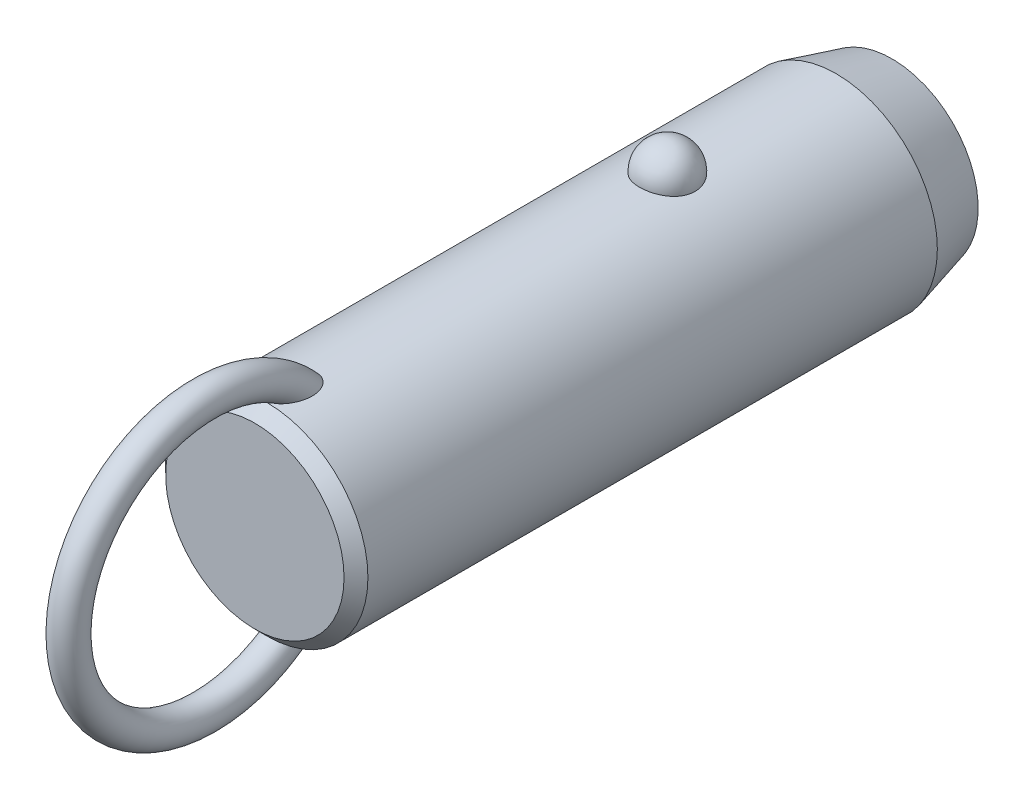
ISO-10303-21;
HEADER;
FILE_DESCRIPTION(('STEP AP214'),'2;1');
FILE_NAME('part.step','',(''),(''),'','','');
FILE_SCHEMA(('AUTOMOTIVE_DESIGN { 1 0 10303 214 1 1 1 1 }'));
ENDSEC;
DATA;
#1=APPLICATION_CONTEXT('core data for automotive mechanical design processes');
#2=APPLICATION_PROTOCOL_DEFINITION('international standard','automotive_design',2000,#1);
#3=PRODUCT_CONTEXT('',#1,'mechanical');
#4=PRODUCT('Part','Part','',(#3));
#5=PRODUCT_RELATED_PRODUCT_CATEGORY('part','',(#4));
#6=PRODUCT_DEFINITION_FORMATION('','',#4);
#7=PRODUCT_DEFINITION_CONTEXT('part definition',#1,'design');
#8=PRODUCT_DEFINITION('design','',#6,#7);
#9=PRODUCT_DEFINITION_SHAPE('','',#8);
#10=(LENGTH_UNIT() NAMED_UNIT(*) SI_UNIT(.MILLI.,.METRE.));
#11=(NAMED_UNIT(*) PLANE_ANGLE_UNIT() SI_UNIT($,.RADIAN.));
#12=(NAMED_UNIT(*) SI_UNIT($,.STERADIAN.) SOLID_ANGLE_UNIT());
#13=UNCERTAINTY_MEASURE_WITH_UNIT(LENGTH_MEASURE(1.E-05),#10,'distance_accuracy_value','');
#14=(GEOMETRIC_REPRESENTATION_CONTEXT(3) GLOBAL_UNCERTAINTY_ASSIGNED_CONTEXT((#13)) GLOBAL_UNIT_ASSIGNED_CONTEXT((#10,
#11,#12)) REPRESENTATION_CONTEXT('',''));
#15=CARTESIAN_POINT('',(0.,0.,0.));
#16=DIRECTION('',(0.,0.,1.));
#17=DIRECTION('',(1.,0.,0.));
#18=AXIS2_PLACEMENT_3D('',#15,#16,#17);
#19=CARTESIAN_POINT('',(0.,0.,35.6));
#20=DIRECTION('',(0.,0.,-1.));
#21=DIRECTION('',(-1.,0.,0.));
#22=AXIS2_PLACEMENT_3D('',#19,#20,#21);
#23=CYLINDRICAL_SURFACE('',#22,12.7);
#24=CARTESIAN_POINT('',(3.46661256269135,12.2177165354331,-3.5));
#25=CARTESIAN_POINT('',(3.4666090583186,12.2177194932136,-3.30432790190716));
#26=CARTESIAN_POINT('',(3.45063567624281,12.2222841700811,-3.10861112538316));
#27=CARTESIAN_POINT('',(3.38712451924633,12.2400345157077,-2.72271899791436));
#28=CARTESIAN_POINT('',(3.33957415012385,12.2532236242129,-2.53254588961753));
#29=CARTESIAN_POINT('',(3.2141234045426,12.286724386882,-2.16324948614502));
#30=CARTESIAN_POINT('',(3.13623639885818,12.3070329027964,-1.98412136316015));
#31=CARTESIAN_POINT('',(2.95205930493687,12.3525018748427,-1.64180592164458));
#32=CARTESIAN_POINT('',(2.84577003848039,12.3776621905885,-1.47861814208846));
#33=CARTESIAN_POINT('',(2.60688050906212,12.4301712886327,-1.17190583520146));
#34=CARTESIAN_POINT('',(2.47415697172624,12.4575299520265,-1.02847897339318));
#35=CARTESIAN_POINT('',(2.18615174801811,12.5112810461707,-0.76617774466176));
#36=CARTESIAN_POINT('',(2.03087002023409,12.5376734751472,-0.647303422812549));
#37=CARTESIAN_POINT('',(1.70237334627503,12.5864761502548,-0.437732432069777));
#38=CARTESIAN_POINT('',(1.52920948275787,12.6088972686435,-0.346958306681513));
#39=CARTESIAN_POINT('',(1.16944170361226,12.6473352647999,-0.195750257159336));
#40=CARTESIAN_POINT('',(0.982839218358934,12.663352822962,-0.13531310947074));
#41=CARTESIAN_POINT('',(0.604961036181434,12.6869706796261,-0.0473241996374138));
#42=CARTESIAN_POINT('',(0.41382314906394,12.6947125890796,-0.0192185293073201));
#43=CARTESIAN_POINT('',(0.0293827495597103,12.7014203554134,0.00517254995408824));
#44=CARTESIAN_POINT('',(-0.163919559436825,12.7003870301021,0.00146092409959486));
#45=CARTESIAN_POINT('',(-0.544374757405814,12.689735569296,-0.037393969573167));
#46=CARTESIAN_POINT('',(-0.731575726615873,12.6802364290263,-0.072101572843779));
#47=CARTESIAN_POINT('',(-1.09733277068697,12.6538333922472,-0.171364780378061));
#48=CARTESIAN_POINT('',(-1.27588869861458,12.6369293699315,-0.235920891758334));
#49=CARTESIAN_POINT('',(-1.6204698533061,12.5973946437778,-0.393548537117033));
#50=CARTESIAN_POINT('',(-1.78641865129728,12.5747321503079,-0.486778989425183));
#51=CARTESIAN_POINT('',(-2.10030671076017,12.5261316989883,-0.699110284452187));
#52=CARTESIAN_POINT('',(-2.24824419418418,12.5001934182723,-0.818213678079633));
#53=CARTESIAN_POINT('',(-2.52491489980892,12.4472906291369,-1.08157124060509));
#54=CARTESIAN_POINT('',(-2.65324222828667,12.4203160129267,-1.22624992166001));
#55=CARTESIAN_POINT('',(-2.88410007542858,12.3687509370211,-1.53528325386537));
#56=CARTESIAN_POINT('',(-2.98662883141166,12.3441606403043,-1.69963924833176));
#57=CARTESIAN_POINT('',(-3.16432417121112,12.2998199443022,-2.04548497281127));
#58=CARTESIAN_POINT('',(-3.23917525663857,12.2801261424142,-2.22714424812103));
#59=CARTESIAN_POINT('',(-3.35800573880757,12.248167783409,-2.6009138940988));
#60=CARTESIAN_POINT('',(-3.4019860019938,12.2359030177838,-2.79302397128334));
#61=CARTESIAN_POINT('',(-3.45784812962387,12.2202347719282,-3.18140279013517));
#62=CARTESIAN_POINT('',(-3.46986123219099,12.2167950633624,-3.37765118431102));
#63=CARTESIAN_POINT('',(-3.46186273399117,12.2190638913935,-3.76943689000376));
#64=CARTESIAN_POINT('',(-3.44185196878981,12.2247721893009,-3.96497421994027));
#65=CARTESIAN_POINT('',(-3.37048652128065,12.2446381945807,-4.34881728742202));
#66=CARTESIAN_POINT('',(-3.31928253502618,12.2587552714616,-4.53715319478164));
#67=CARTESIAN_POINT('',(-3.18693461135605,12.2938237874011,-4.90231727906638));
#68=CARTESIAN_POINT('',(-3.1057895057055,12.3147754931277,-5.07914500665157));
#69=CARTESIAN_POINT('',(-2.91506431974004,12.3613125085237,-5.41732059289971));
#70=CARTESIAN_POINT('',(-2.80533587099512,12.3869217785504,-5.57858147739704));
#71=CARTESIAN_POINT('',(-2.560414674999,12.4398525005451,-5.88013283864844));
#72=CARTESIAN_POINT('',(-2.42522099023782,12.4671740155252,-6.02042254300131));
#73=CARTESIAN_POINT('',(-2.1323357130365,12.5205965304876,-6.27662798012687));
#74=CARTESIAN_POINT('',(-1.97456596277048,12.5466928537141,-6.3924554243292));
#75=CARTESIAN_POINT('',(-1.64115839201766,12.5946384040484,-6.59583547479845));
#76=CARTESIAN_POINT('',(-1.46552179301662,12.6164879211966,-6.68339001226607));
#77=CARTESIAN_POINT('',(-1.10356050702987,12.6532533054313,-6.82682153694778));
#78=CARTESIAN_POINT('',(-0.9173913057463,12.6682500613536,-6.8830698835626));
#79=CARTESIAN_POINT('',(-0.537836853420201,12.6900288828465,-6.96386887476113));
#80=CARTESIAN_POINT('',(-0.344452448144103,12.6968119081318,-6.9884232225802));
#81=CARTESIAN_POINT('',(0.0402577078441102,12.7013667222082,-7.00496469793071));
#82=CARTESIAN_POINT('',(0.231556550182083,12.6993008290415,-6.99753844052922));
#83=CARTESIAN_POINT('',(0.610105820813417,12.6867505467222,-6.9516636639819));
#84=CARTESIAN_POINT('',(0.797356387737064,12.6762664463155,-6.91321620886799));
#85=CARTESIAN_POINT('',(1.16186657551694,12.6480587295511,-6.80658431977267));
#86=CARTESIAN_POINT('',(1.33915951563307,12.6303611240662,-6.73850666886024));
#87=CARTESIAN_POINT('',(1.67968518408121,12.5896027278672,-6.57450875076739));
#88=CARTESIAN_POINT('',(1.84291705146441,12.5665416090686,-6.47858678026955));
#89=CARTESIAN_POINT('',(2.15340192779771,12.5171072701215,-6.25982455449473));
#90=CARTESIAN_POINT('',(2.30037831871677,12.4906895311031,-6.13660186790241));
#91=CARTESIAN_POINT('',(2.5717412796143,12.4376567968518,-5.86739587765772));
#92=CARTESIAN_POINT('',(2.69612388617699,12.4110417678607,-5.72140858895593));
#93=CARTESIAN_POINT('',(2.92107785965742,12.360051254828,-5.40794137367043));
#94=CARTESIAN_POINT('',(3.02121329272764,12.3357209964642,-5.24014110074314));
#95=CARTESIAN_POINT('',(3.19236291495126,12.2925446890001,-4.8896986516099));
#96=CARTESIAN_POINT('',(3.26338839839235,12.2736965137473,-4.70706226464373));
#97=CARTESIAN_POINT('',(3.36788038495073,12.245404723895,-4.35469510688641));
#98=CARTESIAN_POINT('',(3.40484026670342,12.2351018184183,-4.18605935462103));
#99=CARTESIAN_POINT('',(3.45420764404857,12.2212564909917,-3.84496058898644));
#100=CARTESIAN_POINT('',(3.46661565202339,12.2177139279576,-3.67249765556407));
#101=CARTESIAN_POINT('',(3.46661256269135,12.2177165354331,-3.5));
#102=B_SPLINE_CURVE_WITH_KNOTS('',3,(#24,#25,#26,#27,#28,#29,#30,#31,#32,#33,#34,#35,#36,#37,
#38,#39,#40,#41,#42,#43,#44,#45,#46,#47,#48,#49,#50,#51,#52,#53,#54,#55,#56,#57,#58,#59,#60,#61,
#62,#63,#64,#65,#66,#67,#68,#69,#70,#71,#72,#73,#74,#75,#76,#77,#78,#79,#80,#81,#82,#83,#84,#85,
#86,#87,#88,#89,#90,#91,#92,#93,#94,#95,#96,#97,#98,#99,#100,#101),.UNSPECIFIED.,.T.,.F.,(4,2,2,
2,2,2,2,2,2,2,2,2,2,2,2,2,2,2,2,2,2,2,2,2,2,2,2,2,2,2,2,2,2,2,2,2,2,2,4),(0.,0.586396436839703,
1.17302689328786,1.7593990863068,2.34575431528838,2.93491084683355,3.52406845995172,
4.11158733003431,4.69904375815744,5.2762784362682,5.85345931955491,6.42265312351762,
6.99185659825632,7.56427334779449,8.136746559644,8.71981013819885,9.3029135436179,
9.89247258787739,10.4820150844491,11.0691335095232,11.6562366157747,12.2405256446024,
12.8248374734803,13.412244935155,13.9996740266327,14.5891883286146,15.1786623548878,
15.7609861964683,16.3432419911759,16.9148635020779,17.4864654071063,18.0560241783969,
18.6256177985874,19.2037609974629,19.7820055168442,20.3699810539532,20.957728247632,
21.4746855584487,21.9916320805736),.UNSPECIFIED.);
#103=CARTESIAN_POINT('',(3.46661256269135,12.2177165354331,-3.5));
#104=VERTEX_POINT('',#103);
#105=EDGE_CURVE('E41',#104,#104,#102,.T.);
#106=ORIENTED_EDGE('',*,*,#105,.T.);
#107=EDGE_LOOP('',(#106));
#108=FACE_BOUND('',#107,.T.);
#109=CARTESIAN_POINT('',(0.,0.,46.8));
#110=DIRECTION('',(0.,0.,1.));
#111=DIRECTION('',(1.,0.,0.));
#112=AXIS2_PLACEMENT_3D('',#109,#110,#111);
#113=CIRCLE('',#112,12.7);
#114=CARTESIAN_POINT('',(12.7,0.,46.8));
#115=VERTEX_POINT('',#114);
#116=EDGE_CURVE('E10',#115,#115,#113,.F.);
#117=ORIENTED_EDGE('',*,*,#116,.T.);
#118=EDGE_LOOP('',(#117));
#119=FACE_BOUND('',#118,.T.);
#120=CARTESIAN_POINT('',(-0.548122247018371,-12.6881662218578,40.5432187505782));
#121=CARTESIAN_POINT('',(-0.648865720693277,-12.6838128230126,40.577926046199));
#122=CARTESIAN_POINT('',(-0.746398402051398,-12.6783867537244,40.6220428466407));
#123=CARTESIAN_POINT('',(-0.932125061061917,-12.666091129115,40.7267647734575));
#124=CARTESIAN_POINT('',(-1.02030388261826,-12.6592192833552,40.787396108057));
#125=CARTESIAN_POINT('',(-1.18487740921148,-12.6448747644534,40.921847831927));
#126=CARTESIAN_POINT('',(-1.26134296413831,-12.637406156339,40.9955825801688));
#127=CARTESIAN_POINT('',(-1.4023120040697,-12.6225412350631,41.1536045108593));
#128=CARTESIAN_POINT('',(-1.46681470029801,-12.6151449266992,41.2378923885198));
#129=CARTESIAN_POINT('',(-1.60714786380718,-12.5981718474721,41.4496577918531));
#130=CARTESIAN_POINT('',(-1.67725126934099,-12.588900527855,41.580962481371));
#131=CARTESIAN_POINT('',(-1.79536591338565,-12.5725964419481,41.8532471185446));
#132=CARTESIAN_POINT('',(-1.84333535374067,-12.5655679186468,41.9942447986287));
#133=CARTESIAN_POINT('',(-1.93422576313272,-12.5519624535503,42.3376455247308));
#134=CARTESIAN_POINT('',(-1.96788773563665,-12.5466298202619,42.5425578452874));
#135=CARTESIAN_POINT('',(-1.9941399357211,-12.542463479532,42.8517600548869));
#136=CARTESIAN_POINT('',(-1.99883864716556,-12.5417153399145,42.9552987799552));
#137=CARTESIAN_POINT('',(-2.00078003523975,-12.5414074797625,43.1624512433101));
#138=CARTESIAN_POINT('',(-1.99802449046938,-12.5418474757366,43.2660649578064));
#139=CARTESIAN_POINT('',(-1.98336733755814,-12.5441750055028,43.5103207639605));
#140=CARTESIAN_POINT('',(-1.96851430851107,-12.5465291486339,43.6507804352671));
#141=CARTESIAN_POINT('',(-1.92707089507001,-12.5529612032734,43.9299607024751));
#142=CARTESIAN_POINT('',(-1.90047458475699,-12.5570399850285,44.0686803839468));
#143=CARTESIAN_POINT('',(-1.83619120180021,-12.5666008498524,44.3434113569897));
#144=CARTESIAN_POINT('',(-1.79850828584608,-12.57208240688,44.4794236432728));
#145=CARTESIAN_POINT('',(-1.71223796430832,-12.5841228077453,44.7478421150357));
#146=CARTESIAN_POINT('',(-1.66365679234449,-12.5906810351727,44.8802503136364));
#147=CARTESIAN_POINT('',(-1.5780450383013,-12.6016176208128,45.0854887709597));
#148=CARTESIAN_POINT('',(-1.54477252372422,-12.6057501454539,45.1599149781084));
#149=CARTESIAN_POINT('',(-1.47424480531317,-12.6141930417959,45.3068393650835));
#150=CARTESIAN_POINT('',(-1.43699041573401,-12.6185033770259,45.3793379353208));
#151=CARTESIAN_POINT('',(-1.35825795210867,-12.6272207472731,45.5218926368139));
#152=CARTESIAN_POINT('',(-1.31678520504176,-12.6316276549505,45.5919517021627));
#153=CARTESIAN_POINT('',(-1.22917793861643,-12.6404532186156,45.7290705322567));
#154=CARTESIAN_POINT('',(-1.18304514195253,-12.6448718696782,45.7961313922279));
#155=CARTESIAN_POINT('',(-1.07246411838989,-12.6547893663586,45.9438741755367));
#156=CARTESIAN_POINT('',(-1.00642239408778,-12.6602600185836,46.0233844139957));
#157=CARTESIAN_POINT('',(-0.86444142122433,-12.6707460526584,46.1731698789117));
#158=CARTESIAN_POINT('',(-0.788516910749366,-12.6757620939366,46.2434585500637));
#159=CARTESIAN_POINT('',(-0.652215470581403,-12.6833591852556,46.3486801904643));
#160=CARTESIAN_POINT('',(-0.594982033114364,-12.6861973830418,46.3876241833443));
#161=CARTESIAN_POINT('',(-0.47526962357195,-12.6912445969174,46.4564899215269));
#162=CARTESIAN_POINT('',(-0.412800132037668,-12.6934547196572,46.4864275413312));
#163=CARTESIAN_POINT('',(-0.295749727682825,-12.6966636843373,46.5297565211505));
#164=CARTESIAN_POINT('',(-0.241949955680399,-12.6978134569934,46.5452188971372));
#165=CARTESIAN_POINT('',(-0.132508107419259,-12.6994261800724,46.5668845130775));
#166=CARTESIAN_POINT('',(-0.0768679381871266,-12.6998898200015,46.5730970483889));
#167=CARTESIAN_POINT('',(0.0347696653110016,-12.7000752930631,46.5755838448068));
#168=CARTESIAN_POINT('',(0.0907676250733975,-12.6997954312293,46.5718353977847));
#169=CARTESIAN_POINT('',(0.201283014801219,-12.6985255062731,46.5547883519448));
#170=CARTESIAN_POINT('',(0.255799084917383,-12.6975348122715,46.5414812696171));
#171=CARTESIAN_POINT('',(0.37604233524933,-12.6946091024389,46.5020379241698));
#172=CARTESIAN_POINT('',(0.440950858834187,-12.6924943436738,46.4734492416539));
#173=CARTESIAN_POINT('',(0.565350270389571,-12.6875639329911,46.4063234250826));
#174=CARTESIAN_POINT('',(0.624828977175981,-12.6847467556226,46.3677646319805));
#175=CARTESIAN_POINT('',(0.774116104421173,-12.6767252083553,46.256949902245));
#176=CARTESIAN_POINT('',(0.859449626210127,-12.6711344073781,46.1787605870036));
#177=CARTESIAN_POINT('',(1.01789440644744,-12.6593922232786,46.010943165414));
#178=CARTESIAN_POINT('',(1.09096902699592,-12.653239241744,45.921282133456));
#179=CARTESIAN_POINT('',(1.22268793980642,-12.6411674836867,45.7402658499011));
#180=CARTESIAN_POINT('',(1.28193986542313,-12.6352572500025,45.649345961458));
#181=CARTESIAN_POINT('',(1.39259777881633,-12.6235401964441,45.4627929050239));
#182=CARTESIAN_POINT('',(1.44399707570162,-12.6177334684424,45.3671558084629));
#183=CARTESIAN_POINT('',(1.53972870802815,-12.6064093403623,45.1722738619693));
#184=CARTESIAN_POINT('',(1.58405262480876,-12.6008922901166,45.0730248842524));
#185=CARTESIAN_POINT('',(1.66600705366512,-12.5903187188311,44.8717727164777));
#186=CARTESIAN_POINT('',(1.7036365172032,-12.5852622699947,44.7697690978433));
#187=CARTESIAN_POINT('',(1.77545379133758,-12.5753406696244,44.5543580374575));
#188=CARTESIAN_POINT('',(1.80903453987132,-12.5705328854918,44.440745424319));
#189=CARTESIAN_POINT('',(1.86844163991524,-12.5618400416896,44.2114575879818));
#190=CARTESIAN_POINT('',(1.89426665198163,-12.5579551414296,44.0957820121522));
#191=CARTESIAN_POINT('',(1.9378546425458,-12.5513030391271,43.8630072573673));
#192=CARTESIAN_POINT('',(1.9556264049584,-12.5485346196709,43.7459097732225));
#193=CARTESIAN_POINT('',(1.98264463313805,-12.5442934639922,43.5107473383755));
#194=CARTESIAN_POINT('',(1.99189298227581,-12.5428204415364,43.3926826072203));
#195=CARTESIAN_POINT('',(2.00416068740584,-12.540871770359,43.0806225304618));
#196=CARTESIAN_POINT('',(1.99944433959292,-12.541631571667,42.8862290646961));
#197=CARTESIAN_POINT('',(1.96113755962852,-12.5476846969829,42.5003095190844));
#198=CARTESIAN_POINT('',(1.92758341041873,-12.5529723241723,42.3087801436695));
#199=CARTESIAN_POINT('',(1.8393434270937,-12.5661532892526,41.9822728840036));
#200=CARTESIAN_POINT('',(1.79215440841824,-12.5730485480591,41.8452499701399));
#201=CARTESIAN_POINT('',(1.67676242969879,-12.588958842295,41.5804459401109));
#202=CARTESIAN_POINT('',(1.60859050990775,-12.597970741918,41.4526515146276));
#203=CARTESIAN_POINT('',(1.46583832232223,-12.6152829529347,41.2358006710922));
#204=CARTESIAN_POINT('',(1.39525727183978,-12.6233659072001,41.1441050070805));
#205=CARTESIAN_POINT('',(1.23992594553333,-12.6395676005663,40.9734854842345));
#206=CARTESIAN_POINT('',(1.15517932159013,-12.6476863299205,40.8945583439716));
#207=CARTESIAN_POINT('',(0.97199516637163,-12.6630846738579,40.7526438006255));
#208=CARTESIAN_POINT('',(0.873456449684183,-12.6703572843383,40.6897849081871));
#209=CARTESIAN_POINT('',(0.665847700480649,-12.6829569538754,40.5844870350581));
#210=CARTESIAN_POINT('',(0.556784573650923,-12.688285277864,40.5420347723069));
#211=CARTESIAN_POINT('',(0.347338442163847,-12.6956226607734,40.4844434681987));
#212=CARTESIAN_POINT('',(0.247759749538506,-12.6979816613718,40.4663996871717));
#213=CARTESIAN_POINT('',(0.0470218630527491,-12.7003077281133,40.4486007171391));
#214=CARTESIAN_POINT('',(-0.0541350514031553,-12.7002779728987,40.4488212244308));
#215=CARTESIAN_POINT('',(-0.221414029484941,-12.6982482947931,40.4643639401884));
#216=CARTESIAN_POINT('',(-0.288055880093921,-12.6969033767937,40.4746662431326));
#217=CARTESIAN_POINT('',(-0.419599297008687,-12.6932369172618,40.5031348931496));
#218=CARTESIAN_POINT('',(-0.484501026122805,-12.6909154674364,40.5213005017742));
#219=CARTESIAN_POINT('',(-0.548122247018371,-12.6881662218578,40.5432187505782));
#220=B_SPLINE_CURVE_WITH_KNOTS('',3,(#120,#121,#122,#123,#124,#125,#126,#127,#128,#129,#130,
#131,#132,#133,#134,#135,#136,#137,#138,#139,#140,#141,#142,#143,#144,#145,#146,#147,#148,#149,
#150,#151,#152,#153,#154,#155,#156,#157,#158,#159,#160,#161,#162,#163,#164,#165,#166,#167,#168,
#169,#170,#171,#172,#173,#174,#175,#176,#177,#178,#179,#180,#181,#182,#183,#184,#185,#186,#187,
#188,#189,#190,#191,#192,#193,#194,#195,#196,#197,#198,#199,#200,#201,#202,#203,#204,#205,#206,
#207,#208,#209,#210,#211,#212,#213,#214,#215,#216,#217,#218,#219),.UNSPECIFIED.,.T.,.F.,(4,2,2,
2,2,2,2,2,2,2,2,2,2,2,2,2,2,2,2,2,2,2,2,2,2,2,2,2,2,2,2,2,2,2,2,2,2,2,2,2,2,2,2,2,2,2,2,2,2,4),
(0.,0.319642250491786,0.63979475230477,0.957927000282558,1.27608021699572,1.72100165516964,
2.16675988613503,2.78630021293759,3.09705782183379,3.40774128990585,3.83096358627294,
4.25439969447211,4.67767724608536,5.10071330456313,5.34550297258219,5.59024267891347,
5.83467707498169,6.07902143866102,6.38891080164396,6.69834321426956,6.90560910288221,
7.11250749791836,7.27977315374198,7.44687060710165,7.61434932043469,7.78197685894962,
7.99365544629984,8.20579780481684,8.55147335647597,8.89816429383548,9.22375138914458,
9.54961437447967,9.8758622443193,10.202161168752,10.557587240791,10.9130746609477,
11.2681734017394,11.6231936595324,12.2046601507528,12.7853961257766,13.219164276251,
13.6522938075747,13.9989174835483,14.3454519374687,14.6946768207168,15.0436740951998,
15.3457513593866,15.6474266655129,15.8493051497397,16.0511646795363),.UNSPECIFIED.);
#221=CARTESIAN_POINT('',(-0.548122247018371,-12.6881662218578,40.5432187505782));
#222=VERTEX_POINT('',#221);
#223=EDGE_CURVE('E59',#222,#222,#220,.T.);
#224=ORIENTED_EDGE('',*,*,#223,.T.);
#225=EDGE_LOOP('',(#224));
#226=FACE_BOUND('',#225,.T.);
#227=CARTESIAN_POINT('',(-0.548122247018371,12.6881662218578,40.5432187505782));
#228=CARTESIAN_POINT('',(-0.459436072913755,12.6919968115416,40.512673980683));
#229=CARTESIAN_POINT('',(-0.368189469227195,12.6949996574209,40.4893913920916));
#230=CARTESIAN_POINT('',(-0.183024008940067,12.6990186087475,40.4584062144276));
#231=CARTESIAN_POINT('',(-0.0891049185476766,12.7000345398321,40.4507049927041));
#232=CARTESIAN_POINT('',(0.0987147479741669,12.6999636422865,40.4512455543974));
#233=CARTESIAN_POINT('',(0.192615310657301,12.6988761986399,40.4594920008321));
#234=CARTESIAN_POINT('',(0.377658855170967,12.6947211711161,40.4915515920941));
#235=CARTESIAN_POINT('',(0.468801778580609,12.6916535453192,40.5153650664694));
#236=CARTESIAN_POINT('',(0.645809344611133,12.6838788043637,40.5774565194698));
#237=CARTESIAN_POINT('',(0.731679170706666,12.6791733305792,40.615720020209));
#238=CARTESIAN_POINT('',(0.896315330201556,12.6686004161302,40.705120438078));
#239=CARTESIAN_POINT('',(0.975080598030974,12.6627328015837,40.7562592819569));
#240=CARTESIAN_POINT('',(1.12963655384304,12.6499161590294,40.8736782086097));
#241=CARTESIAN_POINT('',(1.20478673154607,12.6429194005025,40.9407929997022));
#242=CARTESIAN_POINT('',(1.34448241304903,12.6288282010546,41.0852250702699));
#243=CARTESIAN_POINT('',(1.40902173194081,12.621733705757,41.1625482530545));
#244=CARTESIAN_POINT('',(1.55208211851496,12.6050877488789,41.3592475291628));
#245=CARTESIAN_POINT('',(1.62510490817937,12.5957546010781,41.4826540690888));
#246=CARTESIAN_POINT('',(1.7501904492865,12.5789823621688,41.7397690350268));
#247=CARTESIAN_POINT('',(1.80221377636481,12.5715468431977,41.873496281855));
#248=CARTESIAN_POINT('',(1.90309965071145,12.5567434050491,42.1983516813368));
#249=CARTESIAN_POINT('',(1.94342317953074,12.5504515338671,42.3921611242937));
#250=CARTESIAN_POINT('',(1.99332997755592,12.5426147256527,42.7837881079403));
#251=CARTESIAN_POINT('',(2.00285305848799,12.5410790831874,42.981612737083));
#252=CARTESIAN_POINT('',(1.99678999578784,12.5420407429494,43.3166427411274));
#253=CARTESIAN_POINT('',(1.98794117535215,12.5434564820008,43.4540428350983));
#254=CARTESIAN_POINT('',(1.95865119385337,12.5480641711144,43.7276394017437));
#255=CARTESIAN_POINT('',(1.93820436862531,12.5512569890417,43.8638352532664));
#256=CARTESIAN_POINT('',(1.88647896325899,12.5591352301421,44.1342493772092));
#257=CARTESIAN_POINT('',(1.85518800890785,12.5638223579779,44.2684652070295));
#258=CARTESIAN_POINT('',(1.78217886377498,12.5743868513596,44.5339362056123));
#259=CARTESIAN_POINT('',(1.74046509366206,12.5802637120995,44.6651926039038));
#260=CARTESIAN_POINT('',(1.66024095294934,12.5910571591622,44.8860855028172));
#261=CARTESIAN_POINT('',(1.62434772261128,12.5957535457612,44.9766904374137));
#262=CARTESIAN_POINT('',(1.54709009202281,12.6054762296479,45.1555125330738));
#263=CARTESIAN_POINT('',(1.50572681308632,12.6105024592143,45.2437301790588));
#264=CARTESIAN_POINT('',(1.41728020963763,12.620748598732,45.4169321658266));
#265=CARTESIAN_POINT('',(1.37021377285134,12.625967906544,45.5019251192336));
#266=CARTESIAN_POINT('',(1.26969620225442,12.6364721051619,45.6680072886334));
#267=CARTESIAN_POINT('',(1.21624929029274,12.6417569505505,45.7490990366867));
#268=CARTESIAN_POINT('',(1.10304413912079,12.6521331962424,45.9047027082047));
#269=CARTESIAN_POINT('',(1.04340936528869,12.657226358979,45.9793033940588));
#270=CARTESIAN_POINT('',(0.915919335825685,12.6670906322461,46.121324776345));
#271=CARTESIAN_POINT('',(0.84806456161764,12.6718617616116,46.1887458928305));
#272=CARTESIAN_POINT('',(0.717035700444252,12.67987711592,46.3006247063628));
#273=CARTESIAN_POINT('',(0.655526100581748,12.6832377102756,46.3469970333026));
#274=CARTESIAN_POINT('',(0.525985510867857,12.6892676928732,46.4296195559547));
#275=CARTESIAN_POINT('',(0.457969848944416,12.6919386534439,46.4658927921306));
#276=CARTESIAN_POINT('',(0.334859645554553,12.695691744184,46.5166572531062));
#277=CARTESIAN_POINT('',(0.281116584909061,12.6970073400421,46.5343733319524));
#278=CARTESIAN_POINT('',(0.171425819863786,12.6989609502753,46.5606429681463));
#279=CARTESIAN_POINT('',(0.115480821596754,12.699599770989,46.5692074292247));
#280=CARTESIAN_POINT('',(0.00272618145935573,12.7001251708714,46.5762531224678));
#281=CARTESIAN_POINT('',(-0.0540859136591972,12.7000089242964,46.5746964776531));
#282=CARTESIAN_POINT('',(-0.166544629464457,12.6990328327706,46.5616005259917));
#283=CARTESIAN_POINT('',(-0.222190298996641,12.6981724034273,46.5500533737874));
#284=CARTESIAN_POINT('',(-0.342018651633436,12.695562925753,46.5149128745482));
#285=CARTESIAN_POINT('',(-0.405606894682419,12.6936676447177,46.4893322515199));
#286=CARTESIAN_POINT('',(-0.527815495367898,12.6891754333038,46.4283111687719));
#287=CARTESIAN_POINT('',(-0.586425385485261,12.6865770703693,46.3928505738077));
#288=CARTESIAN_POINT('',(-0.731842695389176,12.6792129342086,46.2914960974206));
#289=CARTESIAN_POINT('',(-0.814709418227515,12.6740767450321,46.2200395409));
#290=CARTESIAN_POINT('',(-0.969101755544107,12.6632083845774,46.0658900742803));
#291=CARTESIAN_POINT('',(-1.04059564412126,12.6574746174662,45.9831668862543));
#292=CARTESIAN_POINT('',(-1.1698111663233,12.6461638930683,45.8158096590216));
#293=CARTESIAN_POINT('',(-1.22811369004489,12.6405994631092,45.7316166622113));
#294=CARTESIAN_POINT('',(-1.33743405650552,12.6295007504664,45.5585791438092));
#295=CARTESIAN_POINT('',(-1.38844577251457,12.6239664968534,45.4697307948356));
#296=CARTESIAN_POINT('',(-1.48400702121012,12.6130898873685,45.2883895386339));
#297=CARTESIAN_POINT('',(-1.52854232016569,12.6077479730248,45.1958891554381));
#298=CARTESIAN_POINT('',(-1.61150113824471,12.5974127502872,45.0081607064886));
#299=CARTESIAN_POINT('',(-1.64992317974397,12.5924195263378,44.9129319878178));
#300=CARTESIAN_POINT('',(-1.73468589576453,12.581070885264,44.6828936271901));
#301=CARTESIAN_POINT('',(-1.77831261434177,12.5749388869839,44.5470661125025));
#302=CARTESIAN_POINT('',(-1.85439734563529,12.5639437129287,44.2722128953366));
#303=CARTESIAN_POINT('',(-1.88684994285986,12.5590811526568,44.1331856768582));
#304=CARTESIAN_POINT('',(-1.9400848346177,12.550968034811,43.8530923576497));
#305=CARTESIAN_POINT('',(-1.96088706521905,12.5477147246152,43.7120301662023));
#306=CARTESIAN_POINT('',(-1.99000539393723,12.5431291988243,43.4286689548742));
#307=CARTESIAN_POINT('',(-1.99832911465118,12.5417958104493,43.2863707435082));
#308=CARTESIAN_POINT('',(-2.00166624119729,12.5412674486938,42.9576271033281));
#309=CARTESIAN_POINT('',(-1.99178843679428,12.5428579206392,42.771088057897));
#310=CARTESIAN_POINT('',(-1.9445518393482,12.5502731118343,42.4016240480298));
#311=CARTESIAN_POINT('',(-1.90724032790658,12.5560905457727,42.2186934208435));
#312=CARTESIAN_POINT('',(-1.81330718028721,12.5699462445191,41.9048488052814));
#313=CARTESIAN_POINT('',(-1.76338820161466,12.5771273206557,41.7719105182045));
#314=CARTESIAN_POINT('',(-1.6430501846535,12.593414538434,41.515681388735));
#315=CARTESIAN_POINT('',(-1.57265346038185,12.6025185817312,41.392380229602));
#316=CARTESIAN_POINT('',(-1.42634956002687,12.6198178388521,41.1835648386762));
#317=CARTESIAN_POINT('',(-1.35423772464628,12.6278405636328,41.0953846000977));
#318=CARTESIAN_POINT('',(-1.19645664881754,12.6437632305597,40.9321079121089));
#319=CARTESIAN_POINT('',(-1.11080536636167,12.6516633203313,40.8569944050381));
#320=CARTESIAN_POINT('',(-0.947219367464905,12.6648319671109,40.7378114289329));
#321=CARTESIAN_POINT('',(-0.871624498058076,12.670300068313,40.6905414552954));
#322=CARTESIAN_POINT('',(-0.714161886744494,12.6801492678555,40.6077413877));
#323=CARTESIAN_POINT('',(-0.632295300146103,12.684530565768,40.5722091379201));
#324=CARTESIAN_POINT('',(-0.548122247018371,12.6881662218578,40.5432187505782));
#325=B_SPLINE_CURVE_WITH_KNOTS('',3,(#227,#228,#229,#230,#231,#232,#233,#234,#235,#236,#237,
#238,#239,#240,#241,#242,#243,#244,#245,#246,#247,#248,#249,#250,#251,#252,#253,#254,#255,#256,
#257,#258,#259,#260,#261,#262,#263,#264,#265,#266,#267,#268,#269,#270,#271,#272,#273,#274,#275,
#276,#277,#278,#279,#280,#281,#282,#283,#284,#285,#286,#287,#288,#289,#290,#291,#292,#293,#294,
#295,#296,#297,#298,#299,#300,#301,#302,#303,#304,#305,#306,#307,#308,#309,#310,#311,#312,#313,
#314,#315,#316,#317,#318,#319,#320,#321,#322,#323,#324),.UNSPECIFIED.,.T.,.F.,(4,2,2,2,2,2,2,2,
2,2,2,2,2,2,2,2,2,2,2,2,2,2,2,2,2,2,2,2,2,2,2,2,2,2,2,2,2,2,2,2,2,2,2,2,2,2,2,2,4),(0.,
0.281328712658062,0.562682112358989,0.844117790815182,1.12555942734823,1.40671982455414,
1.68792232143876,1.98972294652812,2.2916988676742,2.72039860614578,3.1498994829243,
3.74084916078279,4.33295293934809,4.74554109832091,5.15833092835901,5.57159335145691,
5.98468079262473,6.27722775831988,6.56971484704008,6.86135609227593,7.15280542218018,
7.43927407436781,7.7257259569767,7.9563586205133,8.18646071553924,8.35559393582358,
8.52452541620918,8.69408946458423,8.86378678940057,9.06834348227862,9.27332014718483,
9.60010414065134,9.92778432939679,10.2350252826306,10.5425229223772,10.8506864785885,
11.1589244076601,11.5867893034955,12.0148612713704,12.4421984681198,12.8692745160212,
13.4279365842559,13.9856380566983,14.4107062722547,14.8353130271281,15.1765567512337,
15.5173516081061,15.7844129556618,16.051425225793),.UNSPECIFIED.);
#326=CARTESIAN_POINT('',(-0.548122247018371,12.6881662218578,40.5432187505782));
#327=VERTEX_POINT('',#326);
#328=EDGE_CURVE('E66',#327,#327,#325,.T.);
#329=ORIENTED_EDGE('',*,*,#328,.T.);
#330=EDGE_LOOP('',(#329));
#331=FACE_BOUND('',#330,.T.);
#332=CARTESIAN_POINT('',(0.,0.,-24.6999999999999));
#333=DIRECTION('',(0.,0.,-1.));
#334=DIRECTION('',(-1.,0.,0.));
#335=AXIS2_PLACEMENT_3D('',#332,#333,#334);
#336=CIRCLE('',#335,12.7);
#337=CARTESIAN_POINT('',(-12.7,0.,-24.6999999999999));
#338=VERTEX_POINT('',#337);
#339=EDGE_CURVE('E56',#338,#338,#336,.F.);
#340=ORIENTED_EDGE('',*,*,#339,.T.);
#341=EDGE_LOOP('',(#340));
#342=FACE_BOUND('',#341,.T.);
#343=ADVANCED_FACE('F37',(#108,#119,#226,#331,#342),#23,.T.);
#344=CARTESIAN_POINT('',(0.,0.,-31.7));
#345=DIRECTION('',(0.,0.,-1.));
#346=DIRECTION('',(-1.,0.,0.));
#347=AXIS2_PLACEMENT_3D('',#344,#345,#346);
#348=PLANE('',#347);
#349=CARTESIAN_POINT('',(0.,0.,-31.7));
#350=DIRECTION('',(0.,0.,-1.));
#351=DIRECTION('',(-1.,0.,0.));
#352=AXIS2_PLACEMENT_3D('',#349,#350,#351);
#353=CIRCLE('',#352,10.8243556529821);
#354=CARTESIAN_POINT('',(-10.8243556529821,0.,-31.7));
#355=VERTEX_POINT('',#354);
#356=EDGE_CURVE('E65',#355,#355,#353,.T.);
#357=ORIENTED_EDGE('',*,*,#356,.T.);
#358=EDGE_LOOP('',(#357));
#359=FACE_BOUND('',#358,.T.);
#360=ADVANCED_FACE('F84',(#359),#348,.T.);
#361=CARTESIAN_POINT('',(0.,0.,-31.7));
#362=DIRECTION('',(0.,0.,1.));
#363=DIRECTION('',(1.,0.,0.));
#364=AXIS2_PLACEMENT_3D('',#361,#362,#363);
#365=CONICAL_SURFACE('',#364,10.8243556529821,0.261799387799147);
#366=ORIENTED_EDGE('',*,*,#339,.F.);
#367=EDGE_LOOP('',(#366));
#368=FACE_BOUND('',#367,.T.);
#369=ORIENTED_EDGE('',*,*,#356,.F.);
#370=EDGE_LOOP('',(#369));
#371=FACE_BOUND('',#370,.T.);
#372=ADVANCED_FACE('F82',(#368,#371),#365,.T.);
#373=CARTESIAN_POINT('',(0.,0.,48.3));
#374=DIRECTION('',(0.,0.,1.));
#375=DIRECTION('',(1.,0.,0.));
#376=AXIS2_PLACEMENT_3D('',#373,#374,#375);
#377=PLANE('',#376);
#378=CARTESIAN_POINT('',(0.,0.,48.3));
#379=DIRECTION('',(0.,0.,1.));
#380=DIRECTION('',(1.,0.,0.));
#381=AXIS2_PLACEMENT_3D('',#378,#379,#380);
#382=CIRCLE('',#381,11.2);
#383=CARTESIAN_POINT('',(11.2,0.,48.3));
#384=VERTEX_POINT('',#383);
#385=EDGE_CURVE('E50',#384,#384,#382,.T.);
#386=ORIENTED_EDGE('',*,*,#385,.T.);
#387=EDGE_LOOP('',(#386));
#388=FACE_BOUND('',#387,.T.);
#389=ADVANCED_FACE('F76',(#388),#377,.T.);
#390=CARTESIAN_POINT('',(0.,0.,54.65));
#391=DIRECTION('',(1.,0.,0.));
#392=DIRECTION('',(0.,0.,-1.));
#393=AXIS2_PLACEMENT_3D('',#390,#391,#392);
#394=TOROIDAL_SURFACE('',#393,17.05,2.);
#395=ORIENTED_EDGE('',*,*,#328,.F.);
#396=EDGE_LOOP('',(#395));
#397=FACE_BOUND('',#396,.T.);
#398=ORIENTED_EDGE('',*,*,#223,.F.);
#399=EDGE_LOOP('',(#398));
#400=FACE_BOUND('',#399,.T.);
#401=ADVANCED_FACE('F72',(#397,#400),#394,.T.);
#402=CARTESIAN_POINT('',(0.,0.,48.3));
#403=DIRECTION('',(0.,0.,-1.));
#404=DIRECTION('',(-1.,0.,0.));
#405=AXIS2_PLACEMENT_3D('',#402,#403,#404);
#406=CONICAL_SURFACE('',#405,11.2,0.785398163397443);
#407=ORIENTED_EDGE('',*,*,#116,.F.);
#408=EDGE_LOOP('',(#407));
#409=FACE_BOUND('',#408,.T.);
#410=ORIENTED_EDGE('',*,*,#385,.F.);
#411=EDGE_LOOP('',(#410));
#412=FACE_BOUND('',#411,.T.);
#413=ADVANCED_FACE('F39',(#409,#412),#406,.T.);
#414=CARTESIAN_POINT('',(0.,12.7,-3.5));
#415=DIRECTION('',(0.,1.,0.));
#416=DIRECTION('',(0.,0.,-1.));
#417=AXIS2_PLACEMENT_3D('',#414,#415,#416);
#418=SPHERICAL_SURFACE('',#417,3.5);
#419=ORIENTED_EDGE('',*,*,#105,.F.);
#420=EDGE_LOOP('',(#419));
#421=FACE_BOUND('',#420,.T.);
#422=ADVANCED_FACE('F78',(#421),#418,.T.);
#423=CLOSED_SHELL('',(#343,#360,#372,#389,#401,#413,#422));
#424=MANIFOLD_SOLID_BREP('B2',#423);
#425=ADVANCED_BREP_SHAPE_REPRESENTATION('',(#18,#424),#14);
#426=SHAPE_DEFINITION_REPRESENTATION(#9,#425);
ENDSEC;
END-ISO-10303-21;
